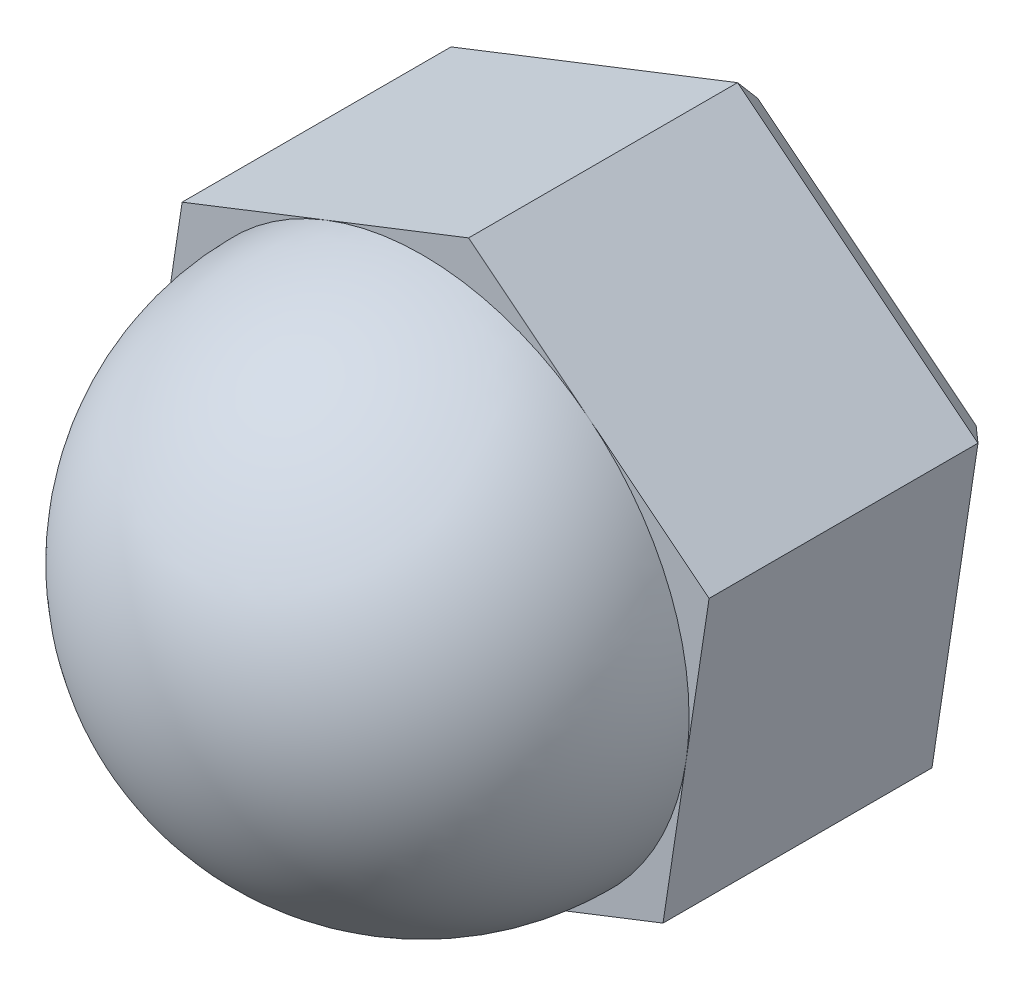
ISO-10303-21;
HEADER;
FILE_DESCRIPTION(('STEP AP214'),'2;1');
FILE_NAME('part.step','',(''),(''),'','','');
FILE_SCHEMA(('AUTOMOTIVE_DESIGN { 1 0 10303 214 1 1 1 1 }'));
ENDSEC;
DATA;
#1=APPLICATION_CONTEXT('core data for automotive mechanical design processes');
#2=APPLICATION_PROTOCOL_DEFINITION('international standard','automotive_design',2000,#1);
#3=PRODUCT_CONTEXT('',#1,'mechanical');
#4=PRODUCT('Part','Part','',(#3));
#5=PRODUCT_RELATED_PRODUCT_CATEGORY('part','',(#4));
#6=PRODUCT_DEFINITION_FORMATION('','',#4);
#7=PRODUCT_DEFINITION_CONTEXT('part definition',#1,'design');
#8=PRODUCT_DEFINITION('design','',#6,#7);
#9=PRODUCT_DEFINITION_SHAPE('','',#8);
#10=(LENGTH_UNIT() NAMED_UNIT(*) SI_UNIT(.MILLI.,.METRE.));
#11=(NAMED_UNIT(*) PLANE_ANGLE_UNIT() SI_UNIT($,.RADIAN.));
#12=(NAMED_UNIT(*) SI_UNIT($,.STERADIAN.) SOLID_ANGLE_UNIT());
#13=UNCERTAINTY_MEASURE_WITH_UNIT(LENGTH_MEASURE(1.E-05),#10,'distance_accuracy_value','');
#14=(GEOMETRIC_REPRESENTATION_CONTEXT(3) GLOBAL_UNCERTAINTY_ASSIGNED_CONTEXT((#13)) GLOBAL_UNIT_ASSIGNED_CONTEXT((#10,
#11,#12)) REPRESENTATION_CONTEXT('',''));
#15=CARTESIAN_POINT('',(0.,0.,0.));
#16=DIRECTION('',(0.,0.,1.));
#17=DIRECTION('',(1.,0.,0.));
#18=AXIS2_PLACEMENT_3D('',#15,#16,#17);
#19=CARTESIAN_POINT('',(0.,0.,3.));
#20=DIRECTION('',(0.,0.,1.));
#21=DIRECTION('',(1.,0.,0.));
#22=AXIS2_PLACEMENT_3D('',#19,#20,#21);
#23=PLANE('',#22);
#24=CARTESIAN_POINT('',(0.,0.,3.));
#25=DIRECTION('',(0.,0.,1.));
#26=DIRECTION('',(1.,0.,0.));
#27=AXIS2_PLACEMENT_3D('',#24,#25,#26);
#28=CIRCLE('',#27,2.725);
#29=CARTESIAN_POINT('',(1.70018429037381,2.1295535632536,3.));
#30=VERTEX_POINT('',#29);
#31=CARTESIAN_POINT('',(-0.994155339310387,2.53717956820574,3.));
#32=VERTEX_POINT('',#31);
#33=EDGE_CURVE('E147',#30,#32,#28,.T.);
#34=ORIENTED_EDGE('',*,*,#33,.F.);
#35=DIRECTION('',(-0.781487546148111,0.62392084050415,0.));
#36=VECTOR('',#35,1.);
#37=CARTESIAN_POINT('',(2.929682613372,1.14795170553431,3.));
#38=LINE('',#37,#36);
#39=CARTESIAN_POINT('',(0.470685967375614,3.11115542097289,3.));
#40=VERTEX_POINT('',#39);
#41=EDGE_CURVE('E138',#30,#40,#38,.T.);
#42=ORIENTED_EDGE('',*,*,#41,.T.);
#43=DIRECTION('',(-0.931075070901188,-0.364827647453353,0.));
#44=VECTOR('',#43,1.);
#45=CARTESIAN_POINT('',(0.470685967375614,3.11115542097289,3.));
#46=LINE('',#45,#44);
#47=EDGE_CURVE('E148',#40,#32,#46,.T.);
#48=ORIENTED_EDGE('',*,*,#47,.T.);
#49=EDGE_LOOP('',(#34,#42,#48));
#50=FACE_BOUND('',#49,.T.);
#51=ADVANCED_FACE('F37',(#50),#23,.T.);
#52=CARTESIAN_POINT('',(-2.69433962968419,0.407626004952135,3.));
#53=VERTEX_POINT('',#52);
#54=EDGE_CURVE('E154',#32,#53,#28,.T.);
#55=ORIENTED_EDGE('',*,*,#54,.F.);
#56=CARTESIAN_POINT('',(-2.45899664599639,1.96320371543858,3.));
#57=VERTEX_POINT('',#56);
#58=EDGE_CURVE('E151',#32,#57,#46,.T.);
#59=ORIENTED_EDGE('',*,*,#58,.T.);
#60=DIRECTION('',(-0.149587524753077,-0.988748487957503,0.));
#61=VECTOR('',#60,1.);
#62=CARTESIAN_POINT('',(-2.45899664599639,1.96320371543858,3.));
#63=LINE('',#62,#61);
#64=EDGE_CURVE('E168',#57,#53,#63,.T.);
#65=ORIENTED_EDGE('',*,*,#64,.T.);
#66=EDGE_LOOP('',(#55,#59,#65));
#67=FACE_BOUND('',#66,.T.);
#68=ADVANCED_FACE('F255',(#67),#23,.T.);
#69=CARTESIAN_POINT('',(-1.70018429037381,-2.1295535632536,3.));
#70=VERTEX_POINT('',#69);
#71=EDGE_CURVE('E321',#53,#70,#28,.T.);
#72=ORIENTED_EDGE('',*,*,#71,.F.);
#73=CARTESIAN_POINT('',(-2.929682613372,-1.14795170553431,3.));
#74=VERTEX_POINT('',#73);
#75=EDGE_CURVE('E167',#53,#74,#63,.T.);
#76=ORIENTED_EDGE('',*,*,#75,.T.);
#77=DIRECTION('',(0.781487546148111,-0.62392084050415,0.));
#78=VECTOR('',#77,1.);
#79=CARTESIAN_POINT('',(-2.929682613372,-1.14795170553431,3.));
#80=LINE('',#79,#78);
#81=EDGE_CURVE('E172',#74,#70,#80,.T.);
#82=ORIENTED_EDGE('',*,*,#81,.T.);
#83=EDGE_LOOP('',(#72,#76,#82));
#84=FACE_BOUND('',#83,.T.);
#85=ADVANCED_FACE('F259',(#84),#23,.T.);
#86=CARTESIAN_POINT('',(0.994155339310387,-2.53717956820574,3.));
#87=VERTEX_POINT('',#86);
#88=EDGE_CURVE('E160',#70,#87,#28,.T.);
#89=ORIENTED_EDGE('',*,*,#88,.F.);
#90=CARTESIAN_POINT('',(-0.470685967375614,-3.11115542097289,3.));
#91=VERTEX_POINT('',#90);
#92=EDGE_CURVE('E171',#70,#91,#80,.T.);
#93=ORIENTED_EDGE('',*,*,#92,.T.);
#94=DIRECTION('',(0.931075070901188,0.364827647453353,0.));
#95=VECTOR('',#94,1.);
#96=CARTESIAN_POINT('',(-0.470685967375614,-3.11115542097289,3.));
#97=LINE('',#96,#95);
#98=EDGE_CURVE('E176',#91,#87,#97,.T.);
#99=ORIENTED_EDGE('',*,*,#98,.T.);
#100=EDGE_LOOP('',(#89,#93,#99));
#101=FACE_BOUND('',#100,.T.);
#102=ADVANCED_FACE('F273',(#101),#23,.T.);
#103=CARTESIAN_POINT('',(2.69433962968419,-0.407626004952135,3.));
#104=VERTEX_POINT('',#103);
#105=EDGE_CURVE('E158',#87,#104,#28,.T.);
#106=ORIENTED_EDGE('',*,*,#105,.F.);
#107=CARTESIAN_POINT('',(2.45899664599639,-1.96320371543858,3.));
#108=VERTEX_POINT('',#107);
#109=EDGE_CURVE('E175',#87,#108,#97,.T.);
#110=ORIENTED_EDGE('',*,*,#109,.T.);
#111=DIRECTION('',(0.149587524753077,0.988748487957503,0.));
#112=VECTOR('',#111,1.);
#113=CARTESIAN_POINT('',(2.45899664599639,-1.96320371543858,3.));
#114=LINE('',#113,#112);
#115=EDGE_CURVE('E145',#108,#104,#114,.T.);
#116=ORIENTED_EDGE('',*,*,#115,.T.);
#117=EDGE_LOOP('',(#106,#110,#116));
#118=FACE_BOUND('',#117,.T.);
#119=ADVANCED_FACE('F263',(#118),#23,.T.);
#120=CARTESIAN_POINT('',(0.470685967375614,3.11115542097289,3.));
#121=DIRECTION('',(0.364827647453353,-0.931075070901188,0.));
#122=DIRECTION('',(0.931075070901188,0.364827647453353,0.));
#123=AXIS2_PLACEMENT_3D('',#120,#121,#122);
#124=PLANE('',#123);
#125=DIRECTION('',(0.,0.,-1.));
#126=VECTOR('',#125,1.);
#127=CARTESIAN_POINT('',(0.470685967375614,3.11115542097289,3.));
#128=LINE('',#127,#126);
#129=CARTESIAN_POINT('',(0.470685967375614,3.11115542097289,0.249999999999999));
#130=VERTEX_POINT('',#129);
#131=EDGE_CURVE('E137',#40,#130,#128,.T.);
#132=ORIENTED_EDGE('',*,*,#131,.T.);
#133=DIRECTION('',(-0.931075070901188,-0.364827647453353,0.));
#134=VECTOR('',#133,1.);
#135=CARTESIAN_POINT('',(0.470685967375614,3.11115542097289,0.249999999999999));
#136=LINE('',#135,#134);
#137=CARTESIAN_POINT('',(-2.45899664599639,1.96320371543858,0.249999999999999));
#138=VERTEX_POINT('',#137);
#139=EDGE_CURVE('E46',#130,#138,#136,.T.);
#140=ORIENTED_EDGE('',*,*,#139,.T.);
#141=DIRECTION('',(0.,0.,-1.));
#142=VECTOR('',#141,1.);
#143=CARTESIAN_POINT('',(-2.45899664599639,1.96320371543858,3.));
#144=LINE('',#143,#142);
#145=EDGE_CURVE('E159',#57,#138,#144,.T.);
#146=ORIENTED_EDGE('',*,*,#145,.F.);
#147=ORIENTED_EDGE('',*,*,#58,.F.);
#148=ORIENTED_EDGE('',*,*,#47,.F.);
#149=EDGE_LOOP('',(#132,#140,#146,#147,#148));
#150=FACE_BOUND('',#149,.T.);
#151=ADVANCED_FACE('F272',(#150),#124,.F.);
#152=CARTESIAN_POINT('',(-2.45899664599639,1.96320371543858,3.));
#153=DIRECTION('',(0.988748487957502,-0.149587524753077,0.));
#154=DIRECTION('',(0.149587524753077,0.988748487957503,0.));
#155=AXIS2_PLACEMENT_3D('',#152,#153,#154);
#156=PLANE('',#155);
#157=ORIENTED_EDGE('',*,*,#145,.T.);
#158=DIRECTION('',(-0.149587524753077,-0.988748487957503,0.));
#159=VECTOR('',#158,1.);
#160=CARTESIAN_POINT('',(-2.45899664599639,1.96320371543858,0.249999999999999));
#161=LINE('',#160,#159);
#162=CARTESIAN_POINT('',(-2.929682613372,-1.14795170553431,0.249999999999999));
#163=VERTEX_POINT('',#162);
#164=EDGE_CURVE('E191',#138,#163,#161,.T.);
#165=ORIENTED_EDGE('',*,*,#164,.T.);
#166=DIRECTION('',(0.,0.,-1.));
#167=VECTOR('',#166,1.);
#168=CARTESIAN_POINT('',(-2.929682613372,-1.14795170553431,3.));
#169=LINE('',#168,#167);
#170=EDGE_CURVE('E162',#74,#163,#169,.T.);
#171=ORIENTED_EDGE('',*,*,#170,.F.);
#172=ORIENTED_EDGE('',*,*,#75,.F.);
#173=ORIENTED_EDGE('',*,*,#64,.F.);
#174=EDGE_LOOP('',(#157,#165,#171,#172,#173));
#175=FACE_BOUND('',#174,.T.);
#176=ADVANCED_FACE('F279',(#175),#156,.F.);
#177=CARTESIAN_POINT('',(-2.929682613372,-1.14795170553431,3.));
#178=DIRECTION('',(0.62392084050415,0.781487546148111,0.));
#179=DIRECTION('',(-0.781487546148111,0.62392084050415,0.));
#180=AXIS2_PLACEMENT_3D('',#177,#178,#179);
#181=PLANE('',#180);
#182=ORIENTED_EDGE('',*,*,#170,.T.);
#183=DIRECTION('',(0.781487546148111,-0.62392084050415,0.));
#184=VECTOR('',#183,1.);
#185=CARTESIAN_POINT('',(-2.929682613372,-1.14795170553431,0.249999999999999));
#186=LINE('',#185,#184);
#187=CARTESIAN_POINT('',(-0.470685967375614,-3.11115542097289,0.249999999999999));
#188=VERTEX_POINT('',#187);
#189=EDGE_CURVE('E210',#163,#188,#186,.T.);
#190=ORIENTED_EDGE('',*,*,#189,.T.);
#191=DIRECTION('',(0.,0.,-1.));
#192=VECTOR('',#191,1.);
#193=CARTESIAN_POINT('',(-0.470685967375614,-3.11115542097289,3.));
#194=LINE('',#193,#192);
#195=EDGE_CURVE('E186',#91,#188,#194,.T.);
#196=ORIENTED_EDGE('',*,*,#195,.F.);
#197=ORIENTED_EDGE('',*,*,#92,.F.);
#198=ORIENTED_EDGE('',*,*,#81,.F.);
#199=EDGE_LOOP('',(#182,#190,#196,#197,#198));
#200=FACE_BOUND('',#199,.T.);
#201=ADVANCED_FACE('F293',(#200),#181,.F.);
#202=CARTESIAN_POINT('',(-0.470685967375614,-3.11115542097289,3.));
#203=DIRECTION('',(-0.364827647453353,0.931075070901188,0.));
#204=DIRECTION('',(-0.931075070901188,-0.364827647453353,0.));
#205=AXIS2_PLACEMENT_3D('',#202,#203,#204);
#206=PLANE('',#205);
#207=ORIENTED_EDGE('',*,*,#195,.T.);
#208=DIRECTION('',(0.931075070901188,0.364827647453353,0.));
#209=VECTOR('',#208,1.);
#210=CARTESIAN_POINT('',(-0.470685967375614,-3.11115542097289,0.249999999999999));
#211=LINE('',#210,#209);
#212=CARTESIAN_POINT('',(2.45899664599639,-1.96320371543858,0.249999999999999));
#213=VERTEX_POINT('',#212);
#214=EDGE_CURVE('E212',#188,#213,#211,.T.);
#215=ORIENTED_EDGE('',*,*,#214,.T.);
#216=DIRECTION('',(0.,0.,-1.));
#217=VECTOR('',#216,1.);
#218=CARTESIAN_POINT('',(2.45899664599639,-1.96320371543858,3.));
#219=LINE('',#218,#217);
#220=EDGE_CURVE('E184',#108,#213,#219,.T.);
#221=ORIENTED_EDGE('',*,*,#220,.F.);
#222=ORIENTED_EDGE('',*,*,#109,.F.);
#223=ORIENTED_EDGE('',*,*,#98,.F.);
#224=EDGE_LOOP('',(#207,#215,#221,#222,#223));
#225=FACE_BOUND('',#224,.T.);
#226=ADVANCED_FACE('F288',(#225),#206,.F.);
#227=CARTESIAN_POINT('',(2.45899664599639,-1.96320371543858,3.));
#228=DIRECTION('',(-0.988748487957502,0.149587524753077,0.));
#229=DIRECTION('',(-0.149587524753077,-0.988748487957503,0.));
#230=AXIS2_PLACEMENT_3D('',#227,#228,#229);
#231=PLANE('',#230);
#232=ORIENTED_EDGE('',*,*,#220,.T.);
#233=DIRECTION('',(0.149587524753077,0.988748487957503,0.));
#234=VECTOR('',#233,1.);
#235=CARTESIAN_POINT('',(2.45899664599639,-1.96320371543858,0.249999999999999));
#236=LINE('',#235,#234);
#237=CARTESIAN_POINT('',(2.929682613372,1.14795170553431,0.249999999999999));
#238=VERTEX_POINT('',#237);
#239=EDGE_CURVE('E62',#213,#238,#236,.T.);
#240=ORIENTED_EDGE('',*,*,#239,.T.);
#241=DIRECTION('',(0.,0.,-1.));
#242=VECTOR('',#241,1.);
#243=CARTESIAN_POINT('',(2.929682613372,1.14795170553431,3.));
#244=LINE('',#243,#242);
#245=CARTESIAN_POINT('',(2.929682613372,1.14795170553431,3.));
#246=VERTEX_POINT('',#245);
#247=EDGE_CURVE('E182',#246,#238,#244,.T.);
#248=ORIENTED_EDGE('',*,*,#247,.F.);
#249=EDGE_CURVE('E136',#104,#246,#114,.T.);
#250=ORIENTED_EDGE('',*,*,#249,.F.);
#251=ORIENTED_EDGE('',*,*,#115,.F.);
#252=EDGE_LOOP('',(#232,#240,#248,#250,#251));
#253=FACE_BOUND('',#252,.T.);
#254=ADVANCED_FACE('F269',(#253),#231,.F.);
#255=CARTESIAN_POINT('',(2.929682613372,1.14795170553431,3.));
#256=DIRECTION('',(-0.62392084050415,-0.781487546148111,0.));
#257=DIRECTION('',(0.781487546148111,-0.62392084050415,0.));
#258=AXIS2_PLACEMENT_3D('',#255,#256,#257);
#259=PLANE('',#258);
#260=ORIENTED_EDGE('',*,*,#247,.T.);
#261=DIRECTION('',(-0.781487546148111,0.62392084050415,0.));
#262=VECTOR('',#261,1.);
#263=CARTESIAN_POINT('',(2.929682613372,1.14795170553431,0.249999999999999));
#264=LINE('',#263,#262);
#265=EDGE_CURVE('E54',#238,#130,#264,.T.);
#266=ORIENTED_EDGE('',*,*,#265,.T.);
#267=ORIENTED_EDGE('',*,*,#131,.F.);
#268=ORIENTED_EDGE('',*,*,#41,.F.);
#269=EDGE_CURVE('E130',#246,#30,#38,.T.);
#270=ORIENTED_EDGE('',*,*,#269,.F.);
#271=EDGE_LOOP('',(#260,#266,#267,#268,#270));
#272=FACE_BOUND('',#271,.T.);
#273=ADVANCED_FACE('F141',(#272),#259,.F.);
#274=EDGE_CURVE('E134',#104,#30,#28,.T.);
#275=ORIENTED_EDGE('',*,*,#274,.F.);
#276=ORIENTED_EDGE('',*,*,#249,.T.);
#277=ORIENTED_EDGE('',*,*,#269,.T.);
#278=EDGE_LOOP('',(#275,#276,#277));
#279=FACE_BOUND('',#278,.T.);
#280=ADVANCED_FACE('F132',(#279),#23,.T.);
#281=CARTESIAN_POINT('',(0.,0.,0.));
#282=DIRECTION('',(0.,0.,1.));
#283=DIRECTION('',(1.,0.,0.));
#284=AXIS2_PLACEMENT_3D('',#281,#282,#283);
#285=PLANE('',#284);
#286=DIRECTION('',(-0.781487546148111,0.62392084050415,0.));
#287=VECTOR('',#286,1.);
#288=CARTESIAN_POINT('',(-1.54420408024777,-1.93418167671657,0.));
#289=LINE('',#288,#287);
#290=CARTESIAN_POINT('',(-0.427503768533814,-2.82572831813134,0.));
#291=VERTEX_POINT('',#290);
#292=CARTESIAN_POINT('',(-2.66090439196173,-1.0426350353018,0.));
#293=VERTEX_POINT('',#292);
#294=EDGE_CURVE('E205',#291,#293,#289,.T.);
#295=ORIENTED_EDGE('',*,*,#294,.T.);
#296=DIRECTION('',(0.149587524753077,0.988748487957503,0.));
#297=VECTOR('',#296,1.);
#298=CARTESIAN_POINT('',(-2.44715250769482,0.370229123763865,0.));
#299=LINE('',#298,#297);
#300=CARTESIAN_POINT('',(-2.23340062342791,1.78309328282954,0.));
#301=VERTEX_POINT('',#300);
#302=EDGE_CURVE('E207',#293,#301,#299,.T.);
#303=ORIENTED_EDGE('',*,*,#302,.T.);
#304=DIRECTION('',(0.931075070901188,0.364827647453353,0.));
#305=VECTOR('',#304,1.);
#306=CARTESIAN_POINT('',(-0.902948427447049,2.30441080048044,0.));
#307=LINE('',#306,#305);
#308=CARTESIAN_POINT('',(0.427503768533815,2.82572831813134,0.));
#309=VERTEX_POINT('',#308);
#310=EDGE_CURVE('E197',#301,#309,#307,.T.);
#311=ORIENTED_EDGE('',*,*,#310,.T.);
#312=DIRECTION('',(0.781487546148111,-0.62392084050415,0.));
#313=VECTOR('',#312,1.);
#314=CARTESIAN_POINT('',(1.54420408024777,1.93418167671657,0.));
#315=LINE('',#314,#313);
#316=CARTESIAN_POINT('',(2.66090439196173,1.04263503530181,0.));
#317=VERTEX_POINT('',#316);
#318=EDGE_CURVE('E199',#309,#317,#315,.T.);
#319=ORIENTED_EDGE('',*,*,#318,.T.);
#320=DIRECTION('',(-0.149587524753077,-0.988748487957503,0.));
#321=VECTOR('',#320,1.);
#322=CARTESIAN_POINT('',(2.44715250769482,-0.370229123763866,0.));
#323=LINE('',#322,#321);
#324=CARTESIAN_POINT('',(2.23340062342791,-1.78309328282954,0.));
#325=VERTEX_POINT('',#324);
#326=EDGE_CURVE('E201',#317,#325,#323,.T.);
#327=ORIENTED_EDGE('',*,*,#326,.T.);
#328=DIRECTION('',(-0.931075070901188,-0.364827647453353,0.));
#329=VECTOR('',#328,1.);
#330=CARTESIAN_POINT('',(0.902948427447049,-2.30441080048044,0.));
#331=LINE('',#330,#329);
#332=EDGE_CURVE('E203',#325,#291,#331,.T.);
#333=ORIENTED_EDGE('',*,*,#332,.T.);
#334=EDGE_LOOP('',(#295,#303,#311,#319,#327,#333));
#335=FACE_BOUND('',#334,.T.);
#336=CARTESIAN_POINT('',(0.,0.,0.));
#337=DIRECTION('',(0.,0.,1.));
#338=DIRECTION('',(1.,0.,0.));
#339=AXIS2_PLACEMENT_3D('',#336,#337,#338);
#340=CIRCLE('',#339,1.75);
#341=CARTESIAN_POINT('',(1.75,0.,0.));
#342=VERTEX_POINT('',#341);
#343=EDGE_CURVE('E194',#342,#342,#340,.T.);
#344=ORIENTED_EDGE('',*,*,#343,.T.);
#345=EDGE_LOOP('',(#344));
#346=FACE_BOUND('',#345,.T.);
#347=ADVANCED_FACE('F251',(#335,#346),#285,.F.);
#348=CARTESIAN_POINT('',(0.,0.,3.));
#349=DIRECTION('',(0.,0.,1.));
#350=DIRECTION('',(1.,0.,0.));
#351=AXIS2_PLACEMENT_3D('',#348,#349,#350);
#352=SPHERICAL_SURFACE('',#351,2.725);
#353=ORIENTED_EDGE('',*,*,#88,.T.);
#354=ORIENTED_EDGE('',*,*,#105,.T.);
#355=ORIENTED_EDGE('',*,*,#274,.T.);
#356=ORIENTED_EDGE('',*,*,#33,.T.);
#357=ORIENTED_EDGE('',*,*,#54,.T.);
#358=ORIENTED_EDGE('',*,*,#71,.T.);
#359=EDGE_LOOP('',(#353,#354,#355,#356,#357,#358));
#360=FACE_BOUND('',#359,.T.);
#361=ADVANCED_FACE('F156',(#360),#352,.T.);
#362=CARTESIAN_POINT('',(0.,0.,4.5));
#363=DIRECTION('',(0.,0.,-1.));
#364=DIRECTION('',(-1.,0.,0.));
#365=AXIS2_PLACEMENT_3D('',#362,#363,#364);
#366=CYLINDRICAL_SURFACE('',#365,1.5);
#367=CARTESIAN_POINT('',(0.,0.,0.249999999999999));
#368=DIRECTION('',(0.,0.,1.));
#369=DIRECTION('',(1.,0.,0.));
#370=AXIS2_PLACEMENT_3D('',#367,#368,#369);
#371=CIRCLE('',#370,1.5);
#372=CARTESIAN_POINT('',(1.5,0.,0.249999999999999));
#373=VERTEX_POINT('',#372);
#374=EDGE_CURVE('E11',#373,#373,#371,.F.);
#375=ORIENTED_EDGE('',*,*,#374,.T.);
#376=EDGE_LOOP('',(#375));
#377=FACE_BOUND('',#376,.T.);
#378=CARTESIAN_POINT('',(0.,0.,4.5));
#379=DIRECTION('',(0.,0.,-1.));
#380=DIRECTION('',(-1.,0.,0.));
#381=AXIS2_PLACEMENT_3D('',#378,#379,#380);
#382=CIRCLE('',#381,1.5);
#383=CARTESIAN_POINT('',(-1.5,0.,4.5));
#384=VERTEX_POINT('',#383);
#385=EDGE_CURVE('E152',#384,#384,#382,.T.);
#386=ORIENTED_EDGE('',*,*,#385,.F.);
#387=EDGE_LOOP('',(#386));
#388=FACE_BOUND('',#387,.T.);
#389=ADVANCED_FACE('F241',(#377,#388),#366,.F.);
#390=CARTESIAN_POINT('',(0.,0.,4.5));
#391=DIRECTION('',(0.,0.,-1.));
#392=DIRECTION('',(-1.,0.,0.));
#393=AXIS2_PLACEMENT_3D('',#390,#391,#392);
#394=PLANE('',#393);
#395=ORIENTED_EDGE('',*,*,#385,.T.);
#396=EDGE_LOOP('',(#395));
#397=FACE_BOUND('',#396,.T.);
#398=ADVANCED_FACE('F239',(#397),#394,.T.);
#399=CARTESIAN_POINT('',(2.45899664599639,-1.96320371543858,0.249999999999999));
#400=DIRECTION('',(-0.699150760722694,0.105774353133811,0.707106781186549));
#401=DIRECTION('',(0.149587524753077,0.988748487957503,0.));
#402=AXIS2_PLACEMENT_3D('',#399,#400,#401);
#403=PLANE('',#402);
#404=DIRECTION('',(-0.590749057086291,0.471639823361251,-0.654653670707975));
#405=VECTOR('',#404,1.);
#406=CARTESIAN_POINT('',(2.45899664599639,-1.96320371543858,0.249999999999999));
#407=LINE('',#406,#405);
#408=EDGE_CURVE('E226',#325,#213,#407,.F.);
#409=ORIENTED_EDGE('',*,*,#408,.F.);
#410=ORIENTED_EDGE('',*,*,#326,.F.);
#411=DIRECTION('',(-0.703826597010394,-0.275783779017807,-0.654653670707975));
#412=VECTOR('',#411,1.);
#413=CARTESIAN_POINT('',(2.929682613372,1.14795170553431,0.249999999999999));
#414=LINE('',#413,#412);
#415=EDGE_CURVE('E41',#238,#317,#414,.T.);
#416=ORIENTED_EDGE('',*,*,#415,.F.);
#417=ORIENTED_EDGE('',*,*,#239,.F.);
#418=EDGE_LOOP('',(#409,#410,#416,#417));
#419=FACE_BOUND('',#418,.T.);
#420=ADVANCED_FACE('F249',(#419),#403,.F.);
#421=CARTESIAN_POINT('',(2.929682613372,1.14795170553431,0.249999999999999));
#422=DIRECTION('',(-0.441178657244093,-0.552595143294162,0.70710678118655));
#423=DIRECTION('',(-0.781487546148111,0.62392084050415,0.));
#424=AXIS2_PLACEMENT_3D('',#421,#422,#423);
#425=PLANE('',#424);
#426=ORIENTED_EDGE('',*,*,#415,.T.);
#427=ORIENTED_EDGE('',*,*,#318,.F.);
#428=DIRECTION('',(-0.113077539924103,-0.747423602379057,-0.654653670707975));
#429=VECTOR('',#428,1.);
#430=CARTESIAN_POINT('',(0.470685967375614,3.11115542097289,0.249999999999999));
#431=LINE('',#430,#429);
#432=EDGE_CURVE('E224',#130,#309,#431,.T.);
#433=ORIENTED_EDGE('',*,*,#432,.F.);
#434=ORIENTED_EDGE('',*,*,#265,.F.);
#435=EDGE_LOOP('',(#426,#427,#433,#434));
#436=FACE_BOUND('',#435,.T.);
#437=ADVANCED_FACE('F313',(#436),#425,.F.);
#438=CARTESIAN_POINT('',(-0.470685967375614,-3.11115542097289,0.249999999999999));
#439=DIRECTION('',(-0.2579721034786,0.658369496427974,0.707106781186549));
#440=DIRECTION('',(0.931075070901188,0.364827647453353,0.));
#441=AXIS2_PLACEMENT_3D('',#438,#439,#440);
#442=PLANE('',#441);
#443=ORIENTED_EDGE('',*,*,#408,.T.);
#444=ORIENTED_EDGE('',*,*,#214,.F.);
#445=DIRECTION('',(0.113077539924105,0.747423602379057,-0.654653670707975));
#446=VECTOR('',#445,1.);
#447=CARTESIAN_POINT('',(-0.470685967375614,-3.11115542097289,0.249999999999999));
#448=LINE('',#447,#446);
#449=EDGE_CURVE('E221',#291,#188,#448,.F.);
#450=ORIENTED_EDGE('',*,*,#449,.F.);
#451=ORIENTED_EDGE('',*,*,#332,.F.);
#452=EDGE_LOOP('',(#443,#444,#450,#451));
#453=FACE_BOUND('',#452,.T.);
#454=ADVANCED_FACE('F296',(#453),#442,.F.);
#455=CARTESIAN_POINT('',(0.470685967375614,3.11115542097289,0.249999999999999));
#456=DIRECTION('',(0.2579721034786,-0.658369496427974,0.70710678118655));
#457=DIRECTION('',(-0.931075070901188,-0.364827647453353,0.));
#458=AXIS2_PLACEMENT_3D('',#455,#456,#457);
#459=PLANE('',#458);
#460=ORIENTED_EDGE('',*,*,#432,.T.);
#461=ORIENTED_EDGE('',*,*,#310,.F.);
#462=DIRECTION('',(-0.590749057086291,0.471639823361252,0.654653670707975));
#463=VECTOR('',#462,1.);
#464=CARTESIAN_POINT('',(-1.7564261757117,1.40228836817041,-0.528571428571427));
#465=LINE('',#464,#463);
#466=EDGE_CURVE('E219',#138,#301,#465,.F.);
#467=ORIENTED_EDGE('',*,*,#466,.F.);
#468=ORIENTED_EDGE('',*,*,#139,.F.);
#469=EDGE_LOOP('',(#460,#461,#467,#468));
#470=FACE_BOUND('',#469,.T.);
#471=ADVANCED_FACE('F310',(#470),#459,.F.);
#472=CARTESIAN_POINT('',(-2.929682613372,-1.14795170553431,0.249999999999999));
#473=DIRECTION('',(0.441178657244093,0.552595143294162,0.70710678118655));
#474=DIRECTION('',(0.781487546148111,-0.62392084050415,0.));
#475=AXIS2_PLACEMENT_3D('',#472,#473,#474);
#476=PLANE('',#475);
#477=ORIENTED_EDGE('',*,*,#449,.T.);
#478=ORIENTED_EDGE('',*,*,#189,.F.);
#479=DIRECTION('',(0.703826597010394,0.275783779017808,-0.654653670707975));
#480=VECTOR('',#479,1.);
#481=CARTESIAN_POINT('',(-2.929682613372,-1.14795170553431,0.249999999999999));
#482=LINE('',#481,#480);
#483=EDGE_CURVE('E217',#293,#163,#482,.F.);
#484=ORIENTED_EDGE('',*,*,#483,.F.);
#485=ORIENTED_EDGE('',*,*,#294,.F.);
#486=EDGE_LOOP('',(#477,#478,#484,#485));
#487=FACE_BOUND('',#486,.T.);
#488=ADVANCED_FACE('F299',(#487),#476,.F.);
#489=CARTESIAN_POINT('',(-2.45899664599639,1.96320371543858,0.249999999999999));
#490=DIRECTION('',(0.699150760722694,-0.105774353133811,0.707106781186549));
#491=DIRECTION('',(-0.149587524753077,-0.988748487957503,0.));
#492=AXIS2_PLACEMENT_3D('',#489,#490,#491);
#493=PLANE('',#492);
#494=ORIENTED_EDGE('',*,*,#466,.T.);
#495=ORIENTED_EDGE('',*,*,#302,.F.);
#496=ORIENTED_EDGE('',*,*,#483,.T.);
#497=ORIENTED_EDGE('',*,*,#164,.F.);
#498=EDGE_LOOP('',(#494,#495,#496,#497));
#499=FACE_BOUND('',#498,.T.);
#500=ADVANCED_FACE('F304',(#499),#493,.F.);
#501=CARTESIAN_POINT('',(0.,0.,0.249999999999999));
#502=DIRECTION('',(0.,0.,-1.));
#503=DIRECTION('',(-1.,0.,0.));
#504=AXIS2_PLACEMENT_3D('',#501,#502,#503);
#505=CONICAL_SURFACE('',#504,1.5,0.785398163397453);
#506=ORIENTED_EDGE('',*,*,#343,.F.);
#507=EDGE_LOOP('',(#506));
#508=FACE_BOUND('',#507,.T.);
#509=ORIENTED_EDGE('',*,*,#374,.F.);
#510=EDGE_LOOP('',(#509));
#511=FACE_BOUND('',#510,.T.);
#512=ADVANCED_FACE('F39',(#508,#511),#505,.F.);
#513=CLOSED_SHELL('',(#51,#68,#85,#102,#119,#151,#176,#201,#226,#254,#273,#280,#347,#361,#389,
#398,#420,#437,#454,#471,#488,#500,#512));
#514=MANIFOLD_SOLID_BREP('B2',#513);
#515=ADVANCED_BREP_SHAPE_REPRESENTATION('',(#18,#514),#14);
#516=SHAPE_DEFINITION_REPRESENTATION(#9,#515);
ENDSEC;
END-ISO-10303-21;
